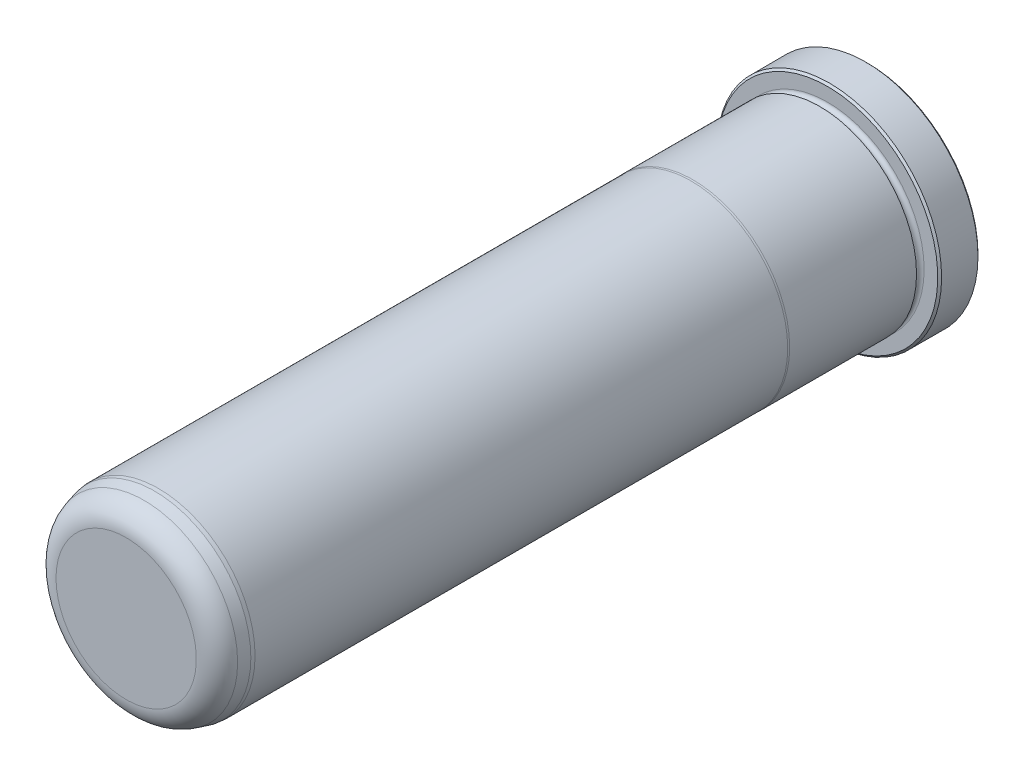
ISO-10303-21;
HEADER;
FILE_DESCRIPTION(('STEP AP214'),'2;1');
FILE_NAME('part.step','',(''),(''),'','','');
FILE_SCHEMA(('AUTOMOTIVE_DESIGN { 1 0 10303 214 1 1 1 1 }'));
ENDSEC;
DATA;
#1=APPLICATION_CONTEXT('core data for automotive mechanical design processes');
#2=APPLICATION_PROTOCOL_DEFINITION('international standard','automotive_design',2000,#1);
#3=PRODUCT_CONTEXT('',#1,'mechanical');
#4=PRODUCT('Part','Part','',(#3));
#5=PRODUCT_RELATED_PRODUCT_CATEGORY('part','',(#4));
#6=PRODUCT_DEFINITION_FORMATION('','',#4);
#7=PRODUCT_DEFINITION_CONTEXT('part definition',#1,'design');
#8=PRODUCT_DEFINITION('design','',#6,#7);
#9=PRODUCT_DEFINITION_SHAPE('','',#8);
#10=(LENGTH_UNIT() NAMED_UNIT(*) SI_UNIT(.MILLI.,.METRE.));
#11=(NAMED_UNIT(*) PLANE_ANGLE_UNIT() SI_UNIT($,.RADIAN.));
#12=(NAMED_UNIT(*) SI_UNIT($,.STERADIAN.) SOLID_ANGLE_UNIT());
#13=UNCERTAINTY_MEASURE_WITH_UNIT(LENGTH_MEASURE(1.E-05),#10,'distance_accuracy_value','');
#14=(GEOMETRIC_REPRESENTATION_CONTEXT(3) GLOBAL_UNCERTAINTY_ASSIGNED_CONTEXT((#13)) GLOBAL_UNIT_ASSIGNED_CONTEXT((#10,
#11,#12)) REPRESENTATION_CONTEXT('',''));
#15=CARTESIAN_POINT('',(0.,0.,0.));
#16=DIRECTION('',(0.,0.,1.));
#17=DIRECTION('',(1.,0.,0.));
#18=AXIS2_PLACEMENT_3D('',#15,#16,#17);
#19=CARTESIAN_POINT('',(0.,0.,0.));
#20=DIRECTION('',(0.,0.,1.));
#21=DIRECTION('',(1.,0.,0.));
#22=AXIS2_PLACEMENT_3D('',#19,#20,#21);
#23=PLANE('',#22);
#24=CARTESIAN_POINT('',(0.,0.,0.));
#25=DIRECTION('',(0.,0.,1.));
#26=DIRECTION('',(1.,0.,0.));
#27=AXIS2_PLACEMENT_3D('',#24,#25,#26);
#28=CIRCLE('',#27,21.717);
#29=CARTESIAN_POINT('',(21.717,0.,0.));
#30=VERTEX_POINT('',#29);
#31=EDGE_CURVE('E37',#30,#30,#28,.F.);
#32=ORIENTED_EDGE('',*,*,#31,.T.);
#33=EDGE_LOOP('',(#32));
#34=FACE_BOUND('',#33,.T.);
#35=ADVANCED_FACE('F30',(#34),#23,.F.);
#36=CARTESIAN_POINT('',(0.,0.,0.));
#37=DIRECTION('',(0.,0.,1.));
#38=DIRECTION('',(1.,0.,0.));
#39=AXIS2_PLACEMENT_3D('',#36,#37,#38);
#40=CYLINDRICAL_SURFACE('',#39,22.098);
#41=CARTESIAN_POINT('',(0.,0.,0.38100000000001));
#42=DIRECTION('',(0.,0.,1.));
#43=DIRECTION('',(1.,0.,0.));
#44=AXIS2_PLACEMENT_3D('',#41,#42,#43);
#45=CIRCLE('',#44,22.098);
#46=CARTESIAN_POINT('',(22.098,0.,0.38100000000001));
#47=VERTEX_POINT('',#46);
#48=EDGE_CURVE('E41',#47,#47,#45,.T.);
#49=ORIENTED_EDGE('',*,*,#48,.T.);
#50=EDGE_LOOP('',(#49));
#51=FACE_BOUND('',#50,.T.);
#52=CARTESIAN_POINT('',(0.,0.,7.54379999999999));
#53=DIRECTION('',(0.,0.,-1.));
#54=DIRECTION('',(-1.,0.,0.));
#55=AXIS2_PLACEMENT_3D('',#52,#53,#54);
#56=CIRCLE('',#55,22.098);
#57=CARTESIAN_POINT('',(-22.098,0.,7.54379999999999));
#58=VERTEX_POINT('',#57);
#59=EDGE_CURVE('E45',#58,#58,#56,.T.);
#60=ORIENTED_EDGE('',*,*,#59,.T.);
#61=EDGE_LOOP('',(#60));
#62=FACE_BOUND('',#61,.T.);
#63=ADVANCED_FACE('F118',(#51,#62),#40,.T.);
#64=CARTESIAN_POINT('',(0.,22.098,7.9248));
#65=DIRECTION('',(0.,0.,-1.));
#66=DIRECTION('',(-1.,0.,0.));
#67=AXIS2_PLACEMENT_3D('',#64,#65,#66);
#68=PLANE('',#67);
#69=CARTESIAN_POINT('',(0.,0.,7.9248));
#70=DIRECTION('',(0.,0.,-1.));
#71=DIRECTION('',(-1.,0.,0.));
#72=AXIS2_PLACEMENT_3D('',#69,#70,#71);
#73=CIRCLE('',#72,21.717);
#74=CARTESIAN_POINT('',(-21.717,0.,7.9248));
#75=VERTEX_POINT('',#74);
#76=EDGE_CURVE('E10',#75,#75,#73,.F.);
#77=ORIENTED_EDGE('',*,*,#76,.T.);
#78=EDGE_LOOP('',(#77));
#79=FACE_BOUND('',#78,.T.);
#80=CARTESIAN_POINT('',(0.,0.,7.9248));
#81=DIRECTION('',(0.,0.,1.));
#82=DIRECTION('',(1.,0.,0.));
#83=AXIS2_PLACEMENT_3D('',#80,#81,#82);
#84=CIRCLE('',#83,19.0373);
#85=CARTESIAN_POINT('',(19.0373,0.,7.9248));
#86=VERTEX_POINT('',#85);
#87=EDGE_CURVE('E56',#86,#86,#84,.T.);
#88=ORIENTED_EDGE('',*,*,#87,.F.);
#89=EDGE_LOOP('',(#88));
#90=FACE_BOUND('',#89,.T.);
#91=ADVANCED_FACE('F113',(#79,#90),#68,.F.);
#92=CARTESIAN_POINT('',(0.,0.,8.6868));
#93=DIRECTION('',(0.,0.,1.));
#94=DIRECTION('',(1.,0.,0.));
#95=AXIS2_PLACEMENT_3D('',#92,#93,#94);
#96=TOROIDAL_SURFACE('',#95,19.0373,0.762);
#97=CARTESIAN_POINT('',(0.,0.,9.4488));
#98=DIRECTION('',(0.,0.,1.));
#99=DIRECTION('',(1.,0.,0.));
#100=AXIS2_PLACEMENT_3D('',#97,#98,#99);
#101=CIRCLE('',#100,19.0373);
#102=CARTESIAN_POINT('',(19.0373,0.,9.4488));
#103=VERTEX_POINT('',#102);
#104=EDGE_CURVE('E59',#103,#103,#101,.T.);
#105=ORIENTED_EDGE('',*,*,#104,.F.);
#106=EDGE_LOOP('',(#105));
#107=FACE_BOUND('',#106,.T.);
#108=ORIENTED_EDGE('',*,*,#87,.T.);
#109=EDGE_LOOP('',(#108));
#110=FACE_BOUND('',#109,.T.);
#111=ADVANCED_FACE('F107',(#107,#110),#96,.F.);
#112=CARTESIAN_POINT('',(0.,19.0373,9.4488));
#113=DIRECTION('',(0.,0.,1.));
#114=DIRECTION('',(1.,0.,0.));
#115=AXIS2_PLACEMENT_3D('',#112,#113,#114);
#116=PLANE('',#115);
#117=CARTESIAN_POINT('',(0.,0.,9.4488));
#118=DIRECTION('',(0.,0.,1.));
#119=DIRECTION('',(1.,0.,0.));
#120=AXIS2_PLACEMENT_3D('',#117,#118,#119);
#121=CIRCLE('',#120,19.0627);
#122=CARTESIAN_POINT('',(19.0627,0.,9.4488));
#123=VERTEX_POINT('',#122);
#124=EDGE_CURVE('E62',#123,#123,#121,.T.);
#125=ORIENTED_EDGE('',*,*,#124,.F.);
#126=EDGE_LOOP('',(#125));
#127=FACE_BOUND('',#126,.T.);
#128=ORIENTED_EDGE('',*,*,#104,.T.);
#129=EDGE_LOOP('',(#128));
#130=FACE_BOUND('',#129,.T.);
#131=ADVANCED_FACE('F101',(#127,#130),#116,.F.);
#132=CARTESIAN_POINT('',(0.,0.,0.));
#133=DIRECTION('',(0.,0.,1.));
#134=DIRECTION('',(1.,0.,0.));
#135=AXIS2_PLACEMENT_3D('',#132,#133,#134);
#136=CYLINDRICAL_SURFACE('',#135,19.0627);
#137=CARTESIAN_POINT('',(0.,0.,34.4347630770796));
#138=DIRECTION('',(0.,0.,1.));
#139=DIRECTION('',(1.,0.,0.));
#140=AXIS2_PLACEMENT_3D('',#137,#138,#139);
#141=CIRCLE('',#140,19.0627);
#142=CARTESIAN_POINT('',(19.0627,0.,34.4347630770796));
#143=VERTEX_POINT('',#142);
#144=EDGE_CURVE('E65',#143,#143,#141,.T.);
#145=ORIENTED_EDGE('',*,*,#144,.F.);
#146=EDGE_LOOP('',(#145));
#147=FACE_BOUND('',#146,.T.);
#148=ORIENTED_EDGE('',*,*,#124,.T.);
#149=EDGE_LOOP('',(#148));
#150=FACE_BOUND('',#149,.T.);
#151=ADVANCED_FACE('F95',(#147,#150),#136,.T.);
#152=CARTESIAN_POINT('',(0.,0.,34.4347630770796));
#153=DIRECTION('',(0.,0.,-1.));
#154=DIRECTION('',(-1.,0.,0.));
#155=AXIS2_PLACEMENT_3D('',#152,#153,#154);
#156=CONICAL_SURFACE('',#155,19.0627,0.0698131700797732);
#157=CARTESIAN_POINT('',(0.,0.,34.798));
#158=DIRECTION('',(0.,0.,1.));
#159=DIRECTION('',(1.,0.,0.));
#160=AXIS2_PLACEMENT_3D('',#157,#158,#159);
#161=CIRCLE('',#160,19.0373);
#162=CARTESIAN_POINT('',(19.0373,0.,34.798));
#163=VERTEX_POINT('',#162);
#164=EDGE_CURVE('E68',#163,#163,#161,.T.);
#165=ORIENTED_EDGE('',*,*,#164,.F.);
#166=EDGE_LOOP('',(#165));
#167=FACE_BOUND('',#166,.T.);
#168=ORIENTED_EDGE('',*,*,#144,.T.);
#169=EDGE_LOOP('',(#168));
#170=FACE_BOUND('',#169,.T.);
#171=ADVANCED_FACE('F89',(#167,#170),#156,.T.);
#172=CARTESIAN_POINT('',(0.,0.,0.));
#173=DIRECTION('',(0.,0.,1.));
#174=DIRECTION('',(1.,0.,0.));
#175=AXIS2_PLACEMENT_3D('',#172,#173,#174);
#176=CYLINDRICAL_SURFACE('',#175,19.0373);
#177=CARTESIAN_POINT('',(0.,0.,139.7));
#178=DIRECTION('',(0.,0.,1.));
#179=DIRECTION('',(1.,0.,0.));
#180=AXIS2_PLACEMENT_3D('',#177,#178,#179);
#181=CIRCLE('',#180,19.0373);
#182=CARTESIAN_POINT('',(19.0373,0.,139.7));
#183=VERTEX_POINT('',#182);
#184=EDGE_CURVE('E71',#183,#183,#181,.T.);
#185=ORIENTED_EDGE('',*,*,#184,.F.);
#186=EDGE_LOOP('',(#185));
#187=FACE_BOUND('',#186,.T.);
#188=ORIENTED_EDGE('',*,*,#164,.T.);
#189=EDGE_LOOP('',(#188));
#190=FACE_BOUND('',#189,.T.);
#191=ADVANCED_FACE('F83',(#187,#190),#176,.T.);
#192=CARTESIAN_POINT('',(0.,0.,139.7));
#193=DIRECTION('',(0.,0.,-1.));
#194=DIRECTION('',(-1.,0.,0.));
#195=AXIS2_PLACEMENT_3D('',#192,#193,#194);
#196=CONICAL_SURFACE('',#195,19.0373,0.0872664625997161);
#197=CARTESIAN_POINT('',(0.,0.,140.462));
#198=DIRECTION('',(0.,0.,1.));
#199=DIRECTION('',(1.,0.,0.));
#200=AXIS2_PLACEMENT_3D('',#197,#198,#199);
#201=CIRCLE('',#200,18.9706336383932);
#202=CARTESIAN_POINT('',(18.9706336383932,0.,140.462));
#203=VERTEX_POINT('',#202);
#204=EDGE_CURVE('E74',#203,#203,#201,.T.);
#205=ORIENTED_EDGE('',*,*,#204,.F.);
#206=EDGE_LOOP('',(#205));
#207=FACE_BOUND('',#206,.T.);
#208=ORIENTED_EDGE('',*,*,#184,.T.);
#209=EDGE_LOOP('',(#208));
#210=FACE_BOUND('',#209,.T.);
#211=ADVANCED_FACE('F80',(#207,#210),#196,.T.);
#212=CARTESIAN_POINT('',(0.,0.,140.462));
#213=DIRECTION('',(0.,0.,-1.));
#214=DIRECTION('',(-1.,0.,0.));
#215=AXIS2_PLACEMENT_3D('',#212,#213,#214);
#216=CONICAL_SURFACE('',#215,18.9706336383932,0.26179938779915);
#217=CARTESIAN_POINT('',(0.,0.,142.520125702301));
#218=DIRECTION('',(0.,0.,1.));
#219=DIRECTION('',(1.,0.,0.));
#220=AXIS2_PLACEMENT_3D('',#217,#218,#219);
#221=CIRCLE('',#220,18.41916051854);
#222=CARTESIAN_POINT('',(18.41916051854,0.,142.520125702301));
#223=VERTEX_POINT('',#222);
#224=EDGE_CURVE('E50',#223,#223,#221,.F.);
#225=ORIENTED_EDGE('',*,*,#224,.T.);
#226=EDGE_LOOP('',(#225));
#227=FACE_BOUND('',#226,.T.);
#228=ORIENTED_EDGE('',*,*,#204,.T.);
#229=EDGE_LOOP('',(#228));
#230=FACE_BOUND('',#229,.T.);
#231=ADVANCED_FACE('F78',(#227,#230),#216,.T.);
#232=CARTESIAN_POINT('',(0.,17.4733335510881,146.05));
#233=DIRECTION('',(0.,0.,-1.));
#234=DIRECTION('',(-1.,0.,0.));
#235=AXIS2_PLACEMENT_3D('',#232,#233,#234);
#236=PLANE('',#235);
#237=CARTESIAN_POINT('',(0.,0.,146.05));
#238=DIRECTION('',(0.,0.,-1.));
#239=DIRECTION('',(-1.,0.,0.));
#240=AXIS2_PLACEMENT_3D('',#237,#238,#239);
#241=CIRCLE('',#240,13.8189387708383);
#242=CARTESIAN_POINT('',(-13.8189387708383,0.,146.05));
#243=VERTEX_POINT('',#242);
#244=EDGE_CURVE('E53',#243,#243,#241,.F.);
#245=ORIENTED_EDGE('',*,*,#244,.T.);
#246=EDGE_LOOP('',(#245));
#247=FACE_BOUND('',#246,.T.);
#248=ADVANCED_FACE('F133',(#247),#236,.F.);
#249=CARTESIAN_POINT('',(0.,0.,141.2875));
#250=DIRECTION('',(0.,0.,-1.));
#251=DIRECTION('',(-1.,0.,0.));
#252=AXIS2_PLACEMENT_3D('',#249,#250,#251);
#253=TOROIDAL_SURFACE('',#252,13.8189387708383,4.7625);
#254=ORIENTED_EDGE('',*,*,#224,.F.);
#255=EDGE_LOOP('',(#254));
#256=FACE_BOUND('',#255,.T.);
#257=ORIENTED_EDGE('',*,*,#244,.F.);
#258=EDGE_LOOP('',(#257));
#259=FACE_BOUND('',#258,.T.);
#260=ADVANCED_FACE('F130',(#256,#259),#253,.T.);
#261=CARTESIAN_POINT('',(0.,0.,0.38100000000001));
#262=DIRECTION('',(0.,0.,1.));
#263=DIRECTION('',(1.,0.,0.));
#264=AXIS2_PLACEMENT_3D('',#261,#262,#263);
#265=CONICAL_SURFACE('',#264,22.098,0.785398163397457);
#266=ORIENTED_EDGE('',*,*,#31,.F.);
#267=EDGE_LOOP('',(#266));
#268=FACE_BOUND('',#267,.T.);
#269=ORIENTED_EDGE('',*,*,#48,.F.);
#270=EDGE_LOOP('',(#269));
#271=FACE_BOUND('',#270,.T.);
#272=ADVANCED_FACE('F132',(#268,#271),#265,.T.);
#273=CARTESIAN_POINT('',(0.,0.,7.9248));
#274=DIRECTION('',(0.,0.,-1.));
#275=DIRECTION('',(-1.,0.,0.));
#276=AXIS2_PLACEMENT_3D('',#273,#274,#275);
#277=CONICAL_SURFACE('',#276,21.717,0.785398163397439);
#278=ORIENTED_EDGE('',*,*,#59,.F.);
#279=EDGE_LOOP('',(#278));
#280=FACE_BOUND('',#279,.T.);
#281=ORIENTED_EDGE('',*,*,#76,.F.);
#282=EDGE_LOOP('',(#281));
#283=FACE_BOUND('',#282,.T.);
#284=ADVANCED_FACE('F32',(#280,#283),#277,.T.);
#285=CLOSED_SHELL('',(#35,#63,#91,#111,#131,#151,#171,#191,#211,#231,#248,#260,#272,#284));
#286=MANIFOLD_SOLID_BREP('B2',#285);
#287=ADVANCED_BREP_SHAPE_REPRESENTATION('',(#18,#286),#14);
#288=SHAPE_DEFINITION_REPRESENTATION(#9,#287);
ENDSEC;
END-ISO-10303-21;
